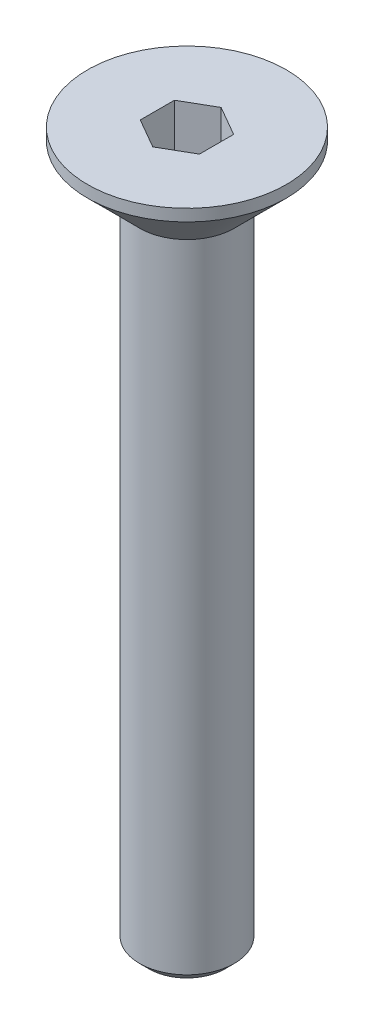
ISO-10303-21;
HEADER;
FILE_DESCRIPTION(('STEP AP214'),'2;1');
FILE_NAME('part.step','',(''),(''),'','','');
FILE_SCHEMA(('AUTOMOTIVE_DESIGN { 1 0 10303 214 1 1 1 1 }'));
ENDSEC;
DATA;
#1=APPLICATION_CONTEXT('core data for automotive mechanical design processes');
#2=APPLICATION_PROTOCOL_DEFINITION('international standard','automotive_design',2000,#1);
#3=PRODUCT_CONTEXT('',#1,'mechanical');
#4=PRODUCT('Part','Part','',(#3));
#5=PRODUCT_RELATED_PRODUCT_CATEGORY('part','',(#4));
#6=PRODUCT_DEFINITION_FORMATION('','',#4);
#7=PRODUCT_DEFINITION_CONTEXT('part definition',#1,'design');
#8=PRODUCT_DEFINITION('design','',#6,#7);
#9=PRODUCT_DEFINITION_SHAPE('','',#8);
#10=(LENGTH_UNIT() NAMED_UNIT(*) SI_UNIT(.MILLI.,.METRE.));
#11=(NAMED_UNIT(*) PLANE_ANGLE_UNIT() SI_UNIT($,.RADIAN.));
#12=(NAMED_UNIT(*) SI_UNIT($,.STERADIAN.) SOLID_ANGLE_UNIT());
#13=UNCERTAINTY_MEASURE_WITH_UNIT(LENGTH_MEASURE(1.E-05),#10,'distance_accuracy_value','');
#14=(GEOMETRIC_REPRESENTATION_CONTEXT(3) GLOBAL_UNCERTAINTY_ASSIGNED_CONTEXT((#13)) GLOBAL_UNIT_ASSIGNED_CONTEXT((#10,
#11,#12)) REPRESENTATION_CONTEXT('',''));
#15=CARTESIAN_POINT('',(0.,0.,0.));
#16=DIRECTION('',(0.,0.,1.));
#17=DIRECTION('',(1.,0.,0.));
#18=AXIS2_PLACEMENT_3D('',#15,#16,#17);
#19=CARTESIAN_POINT('',(-1.25,0.,0.721687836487));
#20=DIRECTION('',(-0.500000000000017,0.,0.866025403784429));
#21=DIRECTION('',(0.866025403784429,0.,0.500000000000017));
#22=AXIS2_PLACEMENT_3D('',#19,#20,#21);
#23=PLANE('',#22);
#24=DIRECTION('',(0.866025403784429,0.,0.500000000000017));
#25=VECTOR('',#24,1.);
#26=CARTESIAN_POINT('',(-1.25,-3.,0.721687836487));
#27=LINE('',#26,#25);
#28=CARTESIAN_POINT('',(-1.25,-3.,0.721687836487));
#29=VERTEX_POINT('',#28);
#30=CARTESIAN_POINT('',(0.,-3.,1.44337567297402));
#31=VERTEX_POINT('',#30);
#32=EDGE_CURVE('E87',#29,#31,#27,.T.);
#33=ORIENTED_EDGE('',*,*,#32,.F.);
#34=DIRECTION('',(0.,1.,0.));
#35=VECTOR('',#34,1.);
#36=CARTESIAN_POINT('',(-1.25,0.,0.721687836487));
#37=LINE('',#36,#35);
#38=CARTESIAN_POINT('',(-1.25,0.,0.721687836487));
#39=VERTEX_POINT('',#38);
#40=EDGE_CURVE('E113',#29,#39,#37,.T.);
#41=ORIENTED_EDGE('',*,*,#40,.T.);
#42=DIRECTION('',(0.866025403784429,0.,0.500000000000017));
#43=VECTOR('',#42,1.);
#44=CARTESIAN_POINT('',(-1.25,0.,0.721687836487));
#45=LINE('',#44,#43);
#46=CARTESIAN_POINT('',(0.,0.,1.44337567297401));
#47=VERTEX_POINT('',#46);
#48=EDGE_CURVE('E100',#47,#39,#45,.F.);
#49=ORIENTED_EDGE('',*,*,#48,.F.);
#50=DIRECTION('',(0.,1.,0.));
#51=VECTOR('',#50,1.);
#52=CARTESIAN_POINT('',(0.,0.,1.44337567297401));
#53=LINE('',#52,#51);
#54=EDGE_CURVE('E104',#47,#31,#53,.F.);
#55=ORIENTED_EDGE('',*,*,#54,.T.);
#56=EDGE_LOOP('',(#33,#41,#49,#55));
#57=FACE_BOUND('',#56,.T.);
#58=ADVANCED_FACE('F16',(#57),#23,.F.);
#59=CARTESIAN_POINT('',(0.,0.,1.443375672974));
#60=DIRECTION('',(0.500000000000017,0.,0.866025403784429));
#61=DIRECTION('',(0.866025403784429,0.,-0.500000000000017));
#62=AXIS2_PLACEMENT_3D('',#59,#60,#61);
#63=PLANE('',#62);
#64=DIRECTION('',(0.866025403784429,0.,-0.500000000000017));
#65=VECTOR('',#64,1.);
#66=CARTESIAN_POINT('',(0.,-3.,1.443375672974));
#67=LINE('',#66,#65);
#68=CARTESIAN_POINT('',(1.24999999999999,-3.,0.721687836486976));
#69=VERTEX_POINT('',#68);
#70=EDGE_CURVE('E92',#31,#69,#67,.T.);
#71=ORIENTED_EDGE('',*,*,#70,.F.);
#72=ORIENTED_EDGE('',*,*,#54,.F.);
#73=DIRECTION('',(0.866025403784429,0.,-0.500000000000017));
#74=VECTOR('',#73,1.);
#75=CARTESIAN_POINT('',(0.,0.,1.443375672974));
#76=LINE('',#75,#74);
#77=CARTESIAN_POINT('',(1.24999999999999,0.,0.721687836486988));
#78=VERTEX_POINT('',#77);
#79=EDGE_CURVE('E99',#78,#47,#76,.F.);
#80=ORIENTED_EDGE('',*,*,#79,.F.);
#81=DIRECTION('',(0.,1.,0.));
#82=VECTOR('',#81,1.);
#83=CARTESIAN_POINT('',(1.25,0.,0.721687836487));
#84=LINE('',#83,#82);
#85=EDGE_CURVE('E109',#78,#69,#84,.F.);
#86=ORIENTED_EDGE('',*,*,#85,.T.);
#87=EDGE_LOOP('',(#71,#72,#80,#86));
#88=FACE_BOUND('',#87,.T.);
#89=ADVANCED_FACE('F108',(#88),#63,.F.);
#90=CARTESIAN_POINT('',(-1.25,0.,-0.721687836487));
#91=DIRECTION('',(-1.,0.,0.));
#92=DIRECTION('',(0.,0.,1.));
#93=AXIS2_PLACEMENT_3D('',#90,#91,#92);
#94=PLANE('',#93);
#95=DIRECTION('',(0.,0.,1.));
#96=VECTOR('',#95,1.);
#97=CARTESIAN_POINT('',(-1.25,-3.,0.));
#98=LINE('',#97,#96);
#99=CARTESIAN_POINT('',(-1.24999999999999,-3.,-0.721687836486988));
#100=VERTEX_POINT('',#99);
#101=EDGE_CURVE('E95',#100,#29,#98,.T.);
#102=ORIENTED_EDGE('',*,*,#101,.F.);
#103=DIRECTION('',(0.,1.,0.));
#104=VECTOR('',#103,1.);
#105=CARTESIAN_POINT('',(-1.24999999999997,0.,-0.721687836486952));
#106=LINE('',#105,#104);
#107=CARTESIAN_POINT('',(-1.24999999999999,0.,-0.721687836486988));
#108=VERTEX_POINT('',#107);
#109=EDGE_CURVE('E125',#100,#108,#106,.T.);
#110=ORIENTED_EDGE('',*,*,#109,.T.);
#111=DIRECTION('',(0.,0.,1.));
#112=VECTOR('',#111,1.);
#113=CARTESIAN_POINT('',(-1.25,0.,-0.721687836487));
#114=LINE('',#113,#112);
#115=EDGE_CURVE('E111',#39,#108,#114,.F.);
#116=ORIENTED_EDGE('',*,*,#115,.F.);
#117=ORIENTED_EDGE('',*,*,#40,.F.);
#118=EDGE_LOOP('',(#102,#110,#116,#117));
#119=FACE_BOUND('',#118,.T.);
#120=ADVANCED_FACE('F244',(#119),#94,.F.);
#121=CARTESIAN_POINT('',(1.25,0.,0.721687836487));
#122=DIRECTION('',(1.,0.,0.));
#123=DIRECTION('',(0.,0.,-1.));
#124=AXIS2_PLACEMENT_3D('',#121,#122,#123);
#125=PLANE('',#124);
#126=DIRECTION('',(0.,0.,1.));
#127=VECTOR('',#126,1.);
#128=CARTESIAN_POINT('',(1.25,-3.,0.));
#129=LINE('',#128,#127);
#130=CARTESIAN_POINT('',(1.25,-3.,-0.721687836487));
#131=VERTEX_POINT('',#130);
#132=EDGE_CURVE('E121',#69,#131,#129,.F.);
#133=ORIENTED_EDGE('',*,*,#132,.F.);
#134=ORIENTED_EDGE('',*,*,#85,.F.);
#135=DIRECTION('',(0.,0.,-1.));
#136=VECTOR('',#135,1.);
#137=CARTESIAN_POINT('',(1.25,0.,0.721687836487));
#138=LINE('',#137,#136);
#139=CARTESIAN_POINT('',(1.25,0.,-0.721687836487));
#140=VERTEX_POINT('',#139);
#141=EDGE_CURVE('E54',#140,#78,#138,.F.);
#142=ORIENTED_EDGE('',*,*,#141,.F.);
#143=DIRECTION('',(0.,1.,0.));
#144=VECTOR('',#143,1.);
#145=CARTESIAN_POINT('',(1.25,0.,-0.721687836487));
#146=LINE('',#145,#144);
#147=EDGE_CURVE('E128',#140,#131,#146,.F.);
#148=ORIENTED_EDGE('',*,*,#147,.T.);
#149=EDGE_LOOP('',(#133,#134,#142,#148));
#150=FACE_BOUND('',#149,.T.);
#151=ADVANCED_FACE('F237',(#150),#125,.F.);
#152=CARTESIAN_POINT('',(0.,-3.,0.));
#153=DIRECTION('',(0.,1.,0.));
#154=DIRECTION('',(0.,0.,1.));
#155=AXIS2_PLACEMENT_3D('',#152,#153,#154);
#156=PLANE('',#155);
#157=DIRECTION('',(-0.866025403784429,0.,-0.500000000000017));
#158=VECTOR('',#157,1.);
#159=CARTESIAN_POINT('',(1.25,-3.,-0.721687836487));
#160=LINE('',#159,#158);
#161=CARTESIAN_POINT('',(0.,-3.,-1.44337567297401));
#162=VERTEX_POINT('',#161);
#163=EDGE_CURVE('E136',#131,#162,#160,.T.);
#164=ORIENTED_EDGE('',*,*,#163,.T.);
#165=DIRECTION('',(-0.866025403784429,0.,0.500000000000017));
#166=VECTOR('',#165,1.);
#167=CARTESIAN_POINT('',(0.,-3.,-1.443375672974));
#168=LINE('',#167,#166);
#169=EDGE_CURVE('E129',#162,#100,#168,.T.);
#170=ORIENTED_EDGE('',*,*,#169,.T.);
#171=ORIENTED_EDGE('',*,*,#101,.T.);
#172=ORIENTED_EDGE('',*,*,#32,.T.);
#173=ORIENTED_EDGE('',*,*,#70,.T.);
#174=ORIENTED_EDGE('',*,*,#132,.T.);
#175=EDGE_LOOP('',(#164,#170,#171,#172,#173,#174));
#176=FACE_BOUND('',#175,.T.);
#177=ADVANCED_FACE('F89',(#176),#156,.T.);
#178=CARTESIAN_POINT('',(0.,0.,-1.443375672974));
#179=DIRECTION('',(-0.500000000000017,0.,-0.866025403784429));
#180=DIRECTION('',(-0.866025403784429,0.,0.500000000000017));
#181=AXIS2_PLACEMENT_3D('',#178,#179,#180);
#182=PLANE('',#181);
#183=ORIENTED_EDGE('',*,*,#169,.F.);
#184=DIRECTION('',(0.,1.,0.));
#185=VECTOR('',#184,1.);
#186=CARTESIAN_POINT('',(0.,0.,-1.44337567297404));
#187=LINE('',#186,#185);
#188=CARTESIAN_POINT('',(0.,0.,-1.44337567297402));
#189=VERTEX_POINT('',#188);
#190=EDGE_CURVE('E132',#162,#189,#187,.T.);
#191=ORIENTED_EDGE('',*,*,#190,.T.);
#192=DIRECTION('',(-0.866025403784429,0.,0.500000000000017));
#193=VECTOR('',#192,1.);
#194=CARTESIAN_POINT('',(0.,0.,-1.443375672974));
#195=LINE('',#194,#193);
#196=EDGE_CURVE('E123',#108,#189,#195,.F.);
#197=ORIENTED_EDGE('',*,*,#196,.F.);
#198=ORIENTED_EDGE('',*,*,#109,.F.);
#199=EDGE_LOOP('',(#183,#191,#197,#198));
#200=FACE_BOUND('',#199,.T.);
#201=ADVANCED_FACE('F222',(#200),#182,.F.);
#202=CARTESIAN_POINT('',(1.25,0.,-0.721687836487));
#203=DIRECTION('',(0.500000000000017,0.,-0.866025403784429));
#204=DIRECTION('',(-0.866025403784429,0.,-0.500000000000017));
#205=AXIS2_PLACEMENT_3D('',#202,#203,#204);
#206=PLANE('',#205);
#207=ORIENTED_EDGE('',*,*,#163,.F.);
#208=ORIENTED_EDGE('',*,*,#147,.F.);
#209=DIRECTION('',(-0.866025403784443,0.,-0.499999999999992));
#210=VECTOR('',#209,1.);
#211=CARTESIAN_POINT('',(1.25,0.,-0.721687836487));
#212=LINE('',#211,#210);
#213=EDGE_CURVE('E135',#140,#189,#212,.T.);
#214=ORIENTED_EDGE('',*,*,#213,.T.);
#215=ORIENTED_EDGE('',*,*,#190,.F.);
#216=EDGE_LOOP('',(#207,#208,#214,#215));
#217=FACE_BOUND('',#216,.T.);
#218=ADVANCED_FACE('F214',(#217),#206,.F.);
#219=CARTESIAN_POINT('',(0.,0.,0.));
#220=DIRECTION('',(0.,-1.,0.));
#221=DIRECTION('',(0.,0.,-1.));
#222=AXIS2_PLACEMENT_3D('',#219,#220,#221);
#223=PLANE('',#222);
#224=ORIENTED_EDGE('',*,*,#141,.T.);
#225=ORIENTED_EDGE('',*,*,#79,.T.);
#226=ORIENTED_EDGE('',*,*,#48,.T.);
#227=ORIENTED_EDGE('',*,*,#115,.T.);
#228=ORIENTED_EDGE('',*,*,#196,.T.);
#229=ORIENTED_EDGE('',*,*,#213,.F.);
#230=EDGE_LOOP('',(#224,#225,#226,#227,#228,#229));
#231=FACE_BOUND('',#230,.T.);
#232=CARTESIAN_POINT('',(0.,0.,0.));
#233=DIRECTION('',(0.,-1.,0.));
#234=DIRECTION('',(0.,0.,-1.));
#235=AXIS2_PLACEMENT_3D('',#232,#233,#234);
#236=CIRCLE('',#235,4.2);
#237=CARTESIAN_POINT('',(0.,0.,-4.2));
#238=VERTEX_POINT('',#237);
#239=EDGE_CURVE('E20',#238,#238,#236,.T.);
#240=ORIENTED_EDGE('',*,*,#239,.F.);
#241=EDGE_LOOP('',(#240));
#242=FACE_BOUND('',#241,.T.);
#243=ADVANCED_FACE('F169',(#231,#242),#223,.F.);
#244=CARTESIAN_POINT('',(0.,1.5,0.));
#245=DIRECTION('',(0.,-1.,0.));
#246=DIRECTION('',(0.,0.,-1.));
#247=AXIS2_PLACEMENT_3D('',#244,#245,#246);
#248=CYLINDRICAL_SURFACE('',#247,4.2);
#249=ORIENTED_EDGE('',*,*,#239,.T.);
#250=EDGE_LOOP('',(#249));
#251=FACE_BOUND('',#250,.T.);
#252=CARTESIAN_POINT('',(0.,-0.499999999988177,0.));
#253=DIRECTION('',(0.,1.,0.));
#254=DIRECTION('',(1.,0.,0.));
#255=AXIS2_PLACEMENT_3D('',#252,#253,#254);
#256=CIRCLE('',#255,4.20000000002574);
#257=CARTESIAN_POINT('',(4.20000000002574,-0.499999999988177,0.));
#258=VERTEX_POINT('',#257);
#259=EDGE_CURVE('E146',#258,#258,#256,.F.);
#260=ORIENTED_EDGE('',*,*,#259,.F.);
#261=EDGE_LOOP('',(#260));
#262=FACE_BOUND('',#261,.T.);
#263=ADVANCED_FACE('F160',(#251,#262),#248,.T.);
#264=CARTESIAN_POINT('',(0.,-29.5999885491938,0.));
#265=DIRECTION('',(0.,1.,0.));
#266=DIRECTION('',(0.,0.,1.));
#267=AXIS2_PLACEMENT_3D('',#264,#265,#266);
#268=CONICAL_SURFACE('',#267,1.99999083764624,0.785393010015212);
#269=CARTESIAN_POINT('',(0.,-29.5999793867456,0.));
#270=DIRECTION('',(0.,1.,0.));
#271=DIRECTION('',(0.,0.,1.));
#272=AXIS2_PLACEMENT_3D('',#269,#270,#271);
#273=CIRCLE('',#272,2.);
#274=CARTESIAN_POINT('',(-1.99999770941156,-29.5999816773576,0.));
#275=VERTEX_POINT('',#274);
#276=CARTESIAN_POINT('',(1.99999770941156,-29.5999816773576,3.66296180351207E-12));
#277=VERTEX_POINT('',#276);
#278=EDGE_CURVE('E148',#275,#277,#273,.T.);
#279=ORIENTED_EDGE('',*,*,#278,.F.);
#280=DIRECTION('',(0.707103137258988,-0.707110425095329,0.));
#281=VECTOR('',#280,1.);
#282=CARTESIAN_POINT('',(-499000.,498973.542998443,-3.05539285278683E-11));
#283=LINE('',#282,#281);
#284=CARTESIAN_POINT('',(-1.59998608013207,-29.9999974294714,0.));
#285=VERTEX_POINT('',#284);
#286=EDGE_CURVE('E44',#275,#285,#283,.T.);
#287=ORIENTED_EDGE('',*,*,#286,.T.);
#288=CARTESIAN_POINT('',(0.,-30.,0.));
#289=DIRECTION('',(0.,-1.,0.));
#290=DIRECTION('',(0.,0.,-1.));
#291=AXIS2_PLACEMENT_3D('',#288,#289,#290);
#292=CIRCLE('',#291,1.59998350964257);
#293=CARTESIAN_POINT('',(1.59998350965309,-29.9999999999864,4.30823685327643E-12));
#294=VERTEX_POINT('',#293);
#295=EDGE_CURVE('E47',#294,#285,#292,.T.);
#296=ORIENTED_EDGE('',*,*,#295,.F.);
#297=DIRECTION('',(-0.707103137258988,-0.707110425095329,-1.953314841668E-12));
#298=VECTOR('',#297,1.);
#299=CARTESIAN_POINT('',(499000.,498973.542998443,1.37844686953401E-06));
#300=LINE('',#299,#298);
#301=EDGE_CURVE('E35',#294,#277,#300,.F.);
#302=ORIENTED_EDGE('',*,*,#301,.T.);
#303=EDGE_LOOP('',(#279,#287,#296,#302));
#304=FACE_BOUND('',#303,.T.);
#305=ADVANCED_FACE('F158',(#304),#268,.T.);
#306=CARTESIAN_POINT('',(0.,-30.,0.));
#307=DIRECTION('',(0.,-1.,0.));
#308=DIRECTION('',(0.,0.,-1.));
#309=AXIS2_PLACEMENT_3D('',#306,#307,#308);
#310=PLANE('',#309);
#311=CARTESIAN_POINT('',(0.,-30.,0.));
#312=DIRECTION('',(0.,-1.,0.));
#313=DIRECTION('',(0.,0.,-1.));
#314=AXIS2_PLACEMENT_3D('',#311,#312,#313);
#315=CIRCLE('',#314,1.59998350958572);
#316=EDGE_CURVE('E143',#294,#285,#315,.F.);
#317=ORIENTED_EDGE('',*,*,#316,.F.);
#318=ORIENTED_EDGE('',*,*,#295,.T.);
#319=EDGE_LOOP('',(#317,#318));
#320=FACE_BOUND('',#319,.T.);
#321=ADVANCED_FACE('F153',(#320),#310,.T.);
#322=CARTESIAN_POINT('',(0.,-0.499999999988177,0.));
#323=DIRECTION('',(0.,1.,0.));
#324=DIRECTION('',(0.,0.,1.));
#325=AXIS2_PLACEMENT_3D('',#322,#323,#324);
#326=CONICAL_SURFACE('',#325,4.20000000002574,0.785398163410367);
#327=ORIENTED_EDGE('',*,*,#259,.T.);
#328=EDGE_LOOP('',(#327));
#329=FACE_BOUND('',#328,.T.);
#330=CARTESIAN_POINT('',(0.,-2.7,0.));
#331=DIRECTION('',(0.,-1.,0.));
#332=DIRECTION('',(0.,0.,-1.));
#333=AXIS2_PLACEMENT_3D('',#330,#331,#332);
#334=CIRCLE('',#333,2.);
#335=CARTESIAN_POINT('',(0.,-2.7,-2.));
#336=VERTEX_POINT('',#335);
#337=EDGE_CURVE('E26',#336,#336,#334,.T.);
#338=ORIENTED_EDGE('',*,*,#337,.F.);
#339=EDGE_LOOP('',(#338));
#340=FACE_BOUND('',#339,.T.);
#341=ADVANCED_FACE('F167',(#329,#340),#326,.T.);
#342=CARTESIAN_POINT('',(0.,-29.5999885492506,0.));
#343=DIRECTION('',(0.,1.,0.));
#344=DIRECTION('',(-1.,0.,0.));
#345=AXIS2_PLACEMENT_3D('',#342,#343,#344);
#346=CONICAL_SURFACE('',#345,1.99999083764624,0.78539301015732);
#347=ORIENTED_EDGE('',*,*,#286,.F.);
#348=CARTESIAN_POINT('',(0.,-29.5999793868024,0.));
#349=DIRECTION('',(0.,1.,0.));
#350=DIRECTION('',(-1.,0.,0.));
#351=AXIS2_PLACEMENT_3D('',#348,#349,#350);
#352=CIRCLE('',#351,2.);
#353=EDGE_CURVE('E11',#277,#275,#352,.T.);
#354=ORIENTED_EDGE('',*,*,#353,.F.);
#355=ORIENTED_EDGE('',*,*,#301,.F.);
#356=ORIENTED_EDGE('',*,*,#316,.T.);
#357=EDGE_LOOP('',(#347,#354,#355,#356));
#358=FACE_BOUND('',#357,.T.);
#359=ADVANCED_FACE('F155',(#358),#346,.T.);
#360=CARTESIAN_POINT('',(0.,1.5,0.));
#361=DIRECTION('',(0.,-1.,0.));
#362=DIRECTION('',(0.,0.,-1.));
#363=AXIS2_PLACEMENT_3D('',#360,#361,#362);
#364=CYLINDRICAL_SURFACE('',#363,2.);
#365=ORIENTED_EDGE('',*,*,#337,.T.);
#366=EDGE_LOOP('',(#365));
#367=FACE_BOUND('',#366,.T.);
#368=ORIENTED_EDGE('',*,*,#353,.T.);
#369=ORIENTED_EDGE('',*,*,#278,.T.);
#370=EDGE_LOOP('',(#368,#369));
#371=FACE_BOUND('',#370,.T.);
#372=ADVANCED_FACE('F18',(#367,#371),#364,.T.);
#373=CLOSED_SHELL('',(#58,#89,#120,#151,#177,#201,#218,#243,#263,#305,#321,#341,#359,#372));
#374=MANIFOLD_SOLID_BREP('B1',#373);
#375=ADVANCED_BREP_SHAPE_REPRESENTATION('',(#18,#374),#14);
#376=SHAPE_DEFINITION_REPRESENTATION(#9,#375);
ENDSEC;
END-ISO-10303-21;
